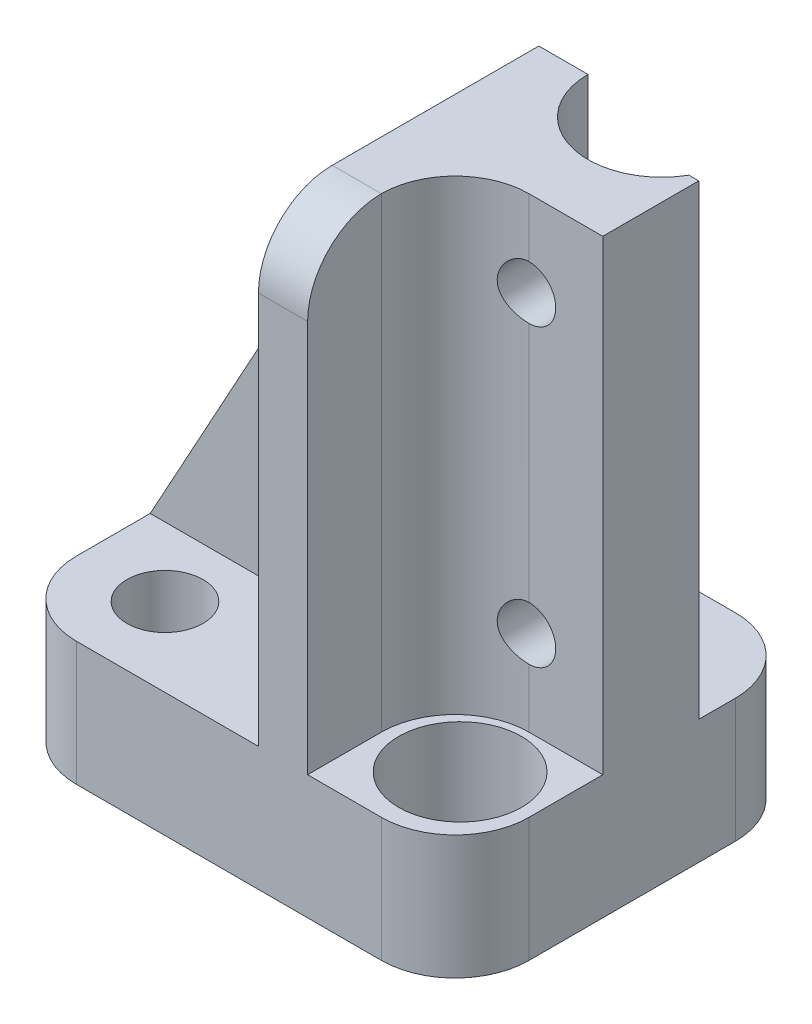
from build123d import *

# Parameters (mm, degrees)
BOSS_EXTRUDE1_DEPTH                            = 19.685
SKETCH3_W                                      = 16.51
SKETCH3_H                                      = 11.1125
SKETCH3_W_2                                    = 9.525
CUT_EXTRUDE2_DEPTH                             = 30.099
CUT_EXTRUDE4_DEPTH                             = 50.363847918
SKETCH18_W                                     = 29.21
SKETCH18_H                                     = 1.5875
CUT_EXTRUDE8_DEPTH                             = 50.363847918
F_10_0_1935_DIAMETER_HOLE2_D                   = 4.9149
FILLET2_R                                      = 4.7625
F_8_32_TAPPED_HOLE1_D                          = 3.4544
CBORE_FOR_8_SOCKET_HEAD_CAP_SCREW2_D           = 4.9149
CBORE_FOR_8_SOCKET_HEAD_CAP_SCREW2_CBORE_D     = 7.9375
CBORE_FOR_8_SOCKET_HEAD_CAP_SCREW2_CBORE_DEPTH = 5.8166
FILLET3_R                                      = 4.7625


with BuildPart() as part:
    # Sketch1 → Boss-Extrude1 (new, symmetric)
    with BuildSketch(Plane.XY):
        Polygon((-24.4475, 0), (4.7625, 0), (4.7625, 38.1), (-7.9375, 38.1), (-24.4475, 8.001), align=None)
    extrude(amount=BOSS_EXTRUDE1_DEPTH, both=True)

    # Sketch3 → Cut-Extrude2 (cut)
    with BuildSketch(Plane(origin=(0, 38.1, 0), x_dir=(1, 0, 0), z_dir=(0, 1, 0))):
        with BuildLine():
            Line((-4.7625, 0), (-7.9375, 0))
            Line((-7.9375, 0), (-7.9375, 19.685))
            Line((-7.9375, 19.685), (4.7625, 19.685))
            Line((4.7625, 19.685), (4.7625, -2.375952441))
            Line((4.7625, -2.375952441), (4.1275, -2.375952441))
            ThreePointArc((4.1275, -2.375952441), (-1.229672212, -4.601012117), (-4.7625, 0))
        make_face()
        with Locations((-16.1925, -14.12875)):
            Rectangle(SKETCH3_W, SKETCH3_H)
        with Locations((0, -14.12875)):
            Rectangle(SKETCH3_W_2, SKETCH3_H)
    extrude(amount=-CUT_EXTRUDE2_DEPTH, mode=Mode.SUBTRACT)

    # Sketch5 → Cut-Extrude4 (cut, through all)
    with BuildSketch(Plane(origin=(0, 38.1, 0), x_dir=(1, 0, 0), z_dir=(0, 1, 0))):
        with BuildLine():
            Line((-24.4475, 19.685), (4.7625, 19.685))
            Line((4.7625, 19.685), (4.7625, 0))
            ThreePointArc((4.7625, 0), (3.367596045, 3.367596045), (0, 4.7625))
            Line((0, 4.7625), (-7.9375, 4.7625))
            Line((-7.9375, 4.7625), (-7.9375, -6.0325))
            Line((-7.9375, -6.0325), (-24.4475, -6.0325))
            Line((-24.4475, -6.0325), (-24.4475, 19.685))
        make_face()
    extrude(amount=-CUT_EXTRUDE4_DEPTH, mode=Mode.SUBTRACT)

    # Sketch18 → Cut-Extrude8 (cut, through all)
    with BuildSketch(Plane(origin=(0, 38.1, 0), x_dir=(1, 0, 0), z_dir=(0, 1, 0))):
        with Locations((-9.8425, -18.89125)):
            Rectangle(SKETCH18_W, SKETCH18_H)
    extrude(amount=-CUT_EXTRUDE8_DEPTH, mode=Mode.SUBTRACT)

    # 10 _0.1935_ Diameter Hole2 (through all)
    with Locations(Plane(origin=(0, 8.001, 0), x_dir=(1, 0, 0), z_dir=(0, 1, 0))):
        with Locations((-19.05, -13.0175), (0, -13.0175)):
            Hole(F_10_0_1935_DIAMETER_HOLE2_D / 2)

    # Fillet2
    fillet2_edges = [part.edges().sort_by_distance(p)[0] for p in [
        (-24.4475, 4.0005, 18.0975),
        (4.7625, 4.0005, 18.0975),
        (-4.7625, 23.0505, 8.5725),
        (-7.9375, 23.0505, 8.5725),
        (-7.9375, 19.05, 6.0325),
        (-7.9375, 4.0005, -4.7625),
    ]]
    fillet(fillet2_edges, radius=FILLET2_R)

    # 8-32 Tapped Hole1 (through all)
    with Locations(Plane.XY.offset(18.0975)):
        with Locations((0, 13.5255), (0, 32.5755)):
            Hole(F_8_32_TAPPED_HOLE1_D / 2)

    # CBORE for _8 Socket Head Cap Screw2 (through all)
    with Locations(Plane(origin=(0, 8.001, 0), x_dir=(1, 0, 0), z_dir=(0, 1, 0))):
        with Locations((0, -13.0175)):
            CounterBoreHole(CBORE_FOR_8_SOCKET_HEAD_CAP_SCREW2_D / 2, CBORE_FOR_8_SOCKET_HEAD_CAP_SCREW2_CBORE_D / 2, CBORE_FOR_8_SOCKET_HEAD_CAP_SCREW2_CBORE_DEPTH)

    # Fillet3
    fillet3_edges = [part.edges().sort_by_distance(p)[0] for p in [
        (-6.35, 38.1, 18.0975),
    ]]
    fillet(fillet3_edges, radius=FILLET3_R)


solid = part.part
